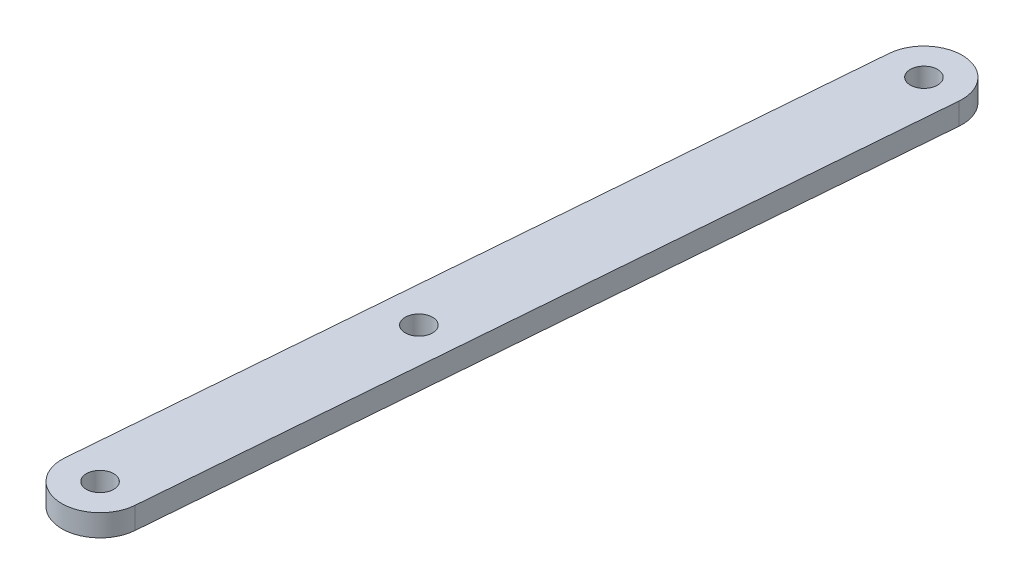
ISO-10303-21;
HEADER;
FILE_DESCRIPTION(('STEP AP214'),'2;1');
FILE_NAME('part.step','',(''),(''),'','','');
FILE_SCHEMA(('AUTOMOTIVE_DESIGN { 1 0 10303 214 1 1 1 1 }'));
ENDSEC;
DATA;
#1=APPLICATION_CONTEXT('core data for automotive mechanical design processes');
#2=APPLICATION_PROTOCOL_DEFINITION('international standard','automotive_design',2000,#1);
#3=PRODUCT_CONTEXT('',#1,'mechanical');
#4=PRODUCT('Part','Part','',(#3));
#5=PRODUCT_RELATED_PRODUCT_CATEGORY('part','',(#4));
#6=PRODUCT_DEFINITION_FORMATION('','',#4);
#7=PRODUCT_DEFINITION_CONTEXT('part definition',#1,'design');
#8=PRODUCT_DEFINITION('design','',#6,#7);
#9=PRODUCT_DEFINITION_SHAPE('','',#8);
#10=(LENGTH_UNIT() NAMED_UNIT(*) SI_UNIT(.MILLI.,.METRE.));
#11=(NAMED_UNIT(*) PLANE_ANGLE_UNIT() SI_UNIT($,.RADIAN.));
#12=(NAMED_UNIT(*) SI_UNIT($,.STERADIAN.) SOLID_ANGLE_UNIT());
#13=UNCERTAINTY_MEASURE_WITH_UNIT(LENGTH_MEASURE(1.E-05),#10,'distance_accuracy_value','');
#14=(GEOMETRIC_REPRESENTATION_CONTEXT(3) GLOBAL_UNCERTAINTY_ASSIGNED_CONTEXT((#13)) GLOBAL_UNIT_ASSIGNED_CONTEXT((#10,
#11,#12)) REPRESENTATION_CONTEXT('',''));
#15=CARTESIAN_POINT('',(0.,0.,0.));
#16=DIRECTION('',(0.,0.,1.));
#17=DIRECTION('',(1.,0.,0.));
#18=AXIS2_PLACEMENT_3D('',#15,#16,#17);
#19=CARTESIAN_POINT('',(71.0986960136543,10.1599999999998,-31.6603907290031));
#20=DIRECTION('',(0.,1.,0.));
#21=DIRECTION('',(0.,0.,1.));
#22=AXIS2_PLACEMENT_3D('',#19,#20,#21);
#23=PLANE('',#22);
#24=CARTESIAN_POINT('',(78.2916462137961,10.1599999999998,-120.268920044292));
#25=DIRECTION('',(0.,1.,0.));
#26=DIRECTION('',(0.,0.,1.));
#27=AXIS2_PLACEMENT_3D('',#24,#25,#26);
#28=CIRCLE('',#27,1.58749999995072);
#29=CARTESIAN_POINT('',(78.2916462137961,10.1599999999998,-118.681420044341));
#30=VERTEX_POINT('',#29);
#31=EDGE_CURVE('E124',#30,#30,#28,.T.);
#32=ORIENTED_EDGE('',*,*,#31,.F.);
#33=EDGE_LOOP('',(#32));
#34=FACE_BOUND('',#33,.T.);
#35=CARTESIAN_POINT('',(73.8822459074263,10.1599999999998,-65.9503907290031));
#36=DIRECTION('',(0.,1.,0.));
#37=DIRECTION('',(0.,0.,1.));
#38=AXIS2_PLACEMENT_3D('',#35,#36,#37);
#39=CIRCLE('',#38,1.58749999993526);
#40=CARTESIAN_POINT('',(73.8822459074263,10.1599999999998,-64.3628907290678));
#41=VERTEX_POINT('',#40);
#42=EDGE_CURVE('E100',#41,#41,#39,.T.);
#43=ORIENTED_EDGE('',*,*,#42,.F.);
#44=EDGE_LOOP('',(#43));
#45=FACE_BOUND('',#44,.T.);
#46=CARTESIAN_POINT('',(71.0986960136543,10.1599999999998,-31.6603907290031));
#47=DIRECTION('',(0.,1.,0.));
#48=DIRECTION('',(0.,0.,1.));
#49=AXIS2_PLACEMENT_3D('',#46,#47,#48);
#50=CIRCLE('',#49,4.44500000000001);
#51=CARTESIAN_POINT('',(66.6682695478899,10.1599999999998,-32.0200382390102));
#52=VERTEX_POINT('',#51);
#53=CARTESIAN_POINT('',(75.5291224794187,10.1599999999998,-31.300743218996));
#54=VERTEX_POINT('',#53);
#55=EDGE_CURVE('E85',#52,#54,#50,.T.);
#56=ORIENTED_EDGE('',*,*,#55,.T.);
#57=DIRECTION('',(0.0809105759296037,0.,-0.996721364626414));
#58=VECTOR('',#57,1.);
#59=CARTESIAN_POINT('',(75.5291224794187,10.1599999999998,-31.300743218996));
#60=LINE('',#59,#58);
#61=CARTESIAN_POINT('',(82.7220726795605,10.1599999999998,-119.909272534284));
#62=VERTEX_POINT('',#61);
#63=EDGE_CURVE('E80',#54,#62,#60,.T.);
#64=ORIENTED_EDGE('',*,*,#63,.T.);
#65=CARTESIAN_POINT('',(78.2916462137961,10.1599999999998,-120.268920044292));
#66=DIRECTION('',(0.,1.,0.));
#67=DIRECTION('',(0.,0.,1.));
#68=AXIS2_PLACEMENT_3D('',#65,#66,#67);
#69=CIRCLE('',#68,4.44500000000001);
#70=CARTESIAN_POINT('',(73.8612197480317,10.1599999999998,-120.628567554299));
#71=VERTEX_POINT('',#70);
#72=EDGE_CURVE('E83',#62,#71,#69,.T.);
#73=ORIENTED_EDGE('',*,*,#72,.T.);
#74=DIRECTION('',(-0.0809105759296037,0.,0.996721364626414));
#75=VECTOR('',#74,1.);
#76=CARTESIAN_POINT('',(66.6682695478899,10.1599999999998,-32.0200382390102));
#77=LINE('',#76,#75);
#78=EDGE_CURVE('E50',#71,#52,#77,.T.);
#79=ORIENTED_EDGE('',*,*,#78,.T.);
#80=EDGE_LOOP('',(#56,#64,#73,#79));
#81=FACE_BOUND('',#80,.T.);
#82=CARTESIAN_POINT('',(71.0986960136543,10.1599999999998,-31.6603907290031));
#83=DIRECTION('',(0.,1.,0.));
#84=DIRECTION('',(0.,0.,1.));
#85=AXIS2_PLACEMENT_3D('',#82,#83,#84);
#86=CIRCLE('',#85,1.58749999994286);
#87=CARTESIAN_POINT('',(71.0986960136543,10.1599999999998,-30.0728907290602));
#88=VERTEX_POINT('',#87);
#89=EDGE_CURVE('E115',#88,#88,#86,.T.);
#90=ORIENTED_EDGE('',*,*,#89,.F.);
#91=EDGE_LOOP('',(#90));
#92=FACE_BOUND('',#91,.T.);
#93=ADVANCED_FACE('F33',(#34,#45,#81,#92),#23,.T.);
#94=CARTESIAN_POINT('',(71.0986960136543,7.61999999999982,-31.6603907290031));
#95=DIRECTION('',(0.,1.,0.));
#96=DIRECTION('',(0.,0.,1.));
#97=AXIS2_PLACEMENT_3D('',#94,#95,#96);
#98=PLANE('',#97);
#99=CARTESIAN_POINT('',(78.2916462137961,7.61999999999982,-120.268920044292));
#100=DIRECTION('',(0.,1.,0.));
#101=DIRECTION('',(0.,0.,1.));
#102=AXIS2_PLACEMENT_3D('',#99,#100,#101);
#103=CIRCLE('',#102,1.58749999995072);
#104=CARTESIAN_POINT('',(78.2916462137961,7.61999999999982,-118.681420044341));
#105=VERTEX_POINT('',#104);
#106=EDGE_CURVE('E121',#105,#105,#103,.T.);
#107=ORIENTED_EDGE('',*,*,#106,.T.);
#108=EDGE_LOOP('',(#107));
#109=FACE_BOUND('',#108,.T.);
#110=CARTESIAN_POINT('',(73.8822459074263,7.61999999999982,-65.9503907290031));
#111=DIRECTION('',(0.,1.,0.));
#112=DIRECTION('',(0.,0.,1.));
#113=AXIS2_PLACEMENT_3D('',#110,#111,#112);
#114=CIRCLE('',#113,1.58749999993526);
#115=CARTESIAN_POINT('',(73.8822459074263,7.61999999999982,-64.3628907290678));
#116=VERTEX_POINT('',#115);
#117=EDGE_CURVE('E112',#116,#116,#114,.T.);
#118=ORIENTED_EDGE('',*,*,#117,.T.);
#119=EDGE_LOOP('',(#118));
#120=FACE_BOUND('',#119,.T.);
#121=CARTESIAN_POINT('',(71.0986960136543,7.61999999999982,-31.6603907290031));
#122=DIRECTION('',(0.,1.,0.));
#123=DIRECTION('',(0.,0.,1.));
#124=AXIS2_PLACEMENT_3D('',#121,#122,#123);
#125=CIRCLE('',#124,4.44500000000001);
#126=CARTESIAN_POINT('',(66.6682695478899,7.61999999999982,-32.0200382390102));
#127=VERTEX_POINT('',#126);
#128=CARTESIAN_POINT('',(75.5291224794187,7.61999999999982,-31.300743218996));
#129=VERTEX_POINT('',#128);
#130=EDGE_CURVE('E97',#127,#129,#125,.T.);
#131=ORIENTED_EDGE('',*,*,#130,.F.);
#132=DIRECTION('',(-0.0809105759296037,0.,0.996721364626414));
#133=VECTOR('',#132,1.);
#134=CARTESIAN_POINT('',(66.6682695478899,7.61999999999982,-32.0200382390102));
#135=LINE('',#134,#133);
#136=CARTESIAN_POINT('',(73.8612197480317,7.61999999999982,-120.628567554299));
#137=VERTEX_POINT('',#136);
#138=EDGE_CURVE('E73',#137,#127,#135,.T.);
#139=ORIENTED_EDGE('',*,*,#138,.F.);
#140=CARTESIAN_POINT('',(78.2916462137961,7.61999999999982,-120.268920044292));
#141=DIRECTION('',(0.,1.,0.));
#142=DIRECTION('',(0.,0.,1.));
#143=AXIS2_PLACEMENT_3D('',#140,#141,#142);
#144=CIRCLE('',#143,4.44500000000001);
#145=CARTESIAN_POINT('',(82.7220726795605,7.61999999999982,-119.909272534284));
#146=VERTEX_POINT('',#145);
#147=EDGE_CURVE('E67',#146,#137,#144,.T.);
#148=ORIENTED_EDGE('',*,*,#147,.F.);
#149=DIRECTION('',(0.0809105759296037,0.,-0.996721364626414));
#150=VECTOR('',#149,1.);
#151=CARTESIAN_POINT('',(75.5291224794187,7.61999999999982,-31.300743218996));
#152=LINE('',#151,#150);
#153=EDGE_CURVE('E89',#129,#146,#152,.T.);
#154=ORIENTED_EDGE('',*,*,#153,.F.);
#155=EDGE_LOOP('',(#131,#139,#148,#154));
#156=FACE_BOUND('',#155,.T.);
#157=CARTESIAN_POINT('',(71.0986960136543,7.61999999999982,-31.6603907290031));
#158=DIRECTION('',(0.,1.,0.));
#159=DIRECTION('',(0.,0.,1.));
#160=AXIS2_PLACEMENT_3D('',#157,#158,#159);
#161=CIRCLE('',#160,1.58749999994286);
#162=CARTESIAN_POINT('',(71.0986960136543,7.61999999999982,-30.0728907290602));
#163=VERTEX_POINT('',#162);
#164=EDGE_CURVE('E118',#163,#163,#161,.T.);
#165=ORIENTED_EDGE('',*,*,#164,.T.);
#166=EDGE_LOOP('',(#165));
#167=FACE_BOUND('',#166,.T.);
#168=ADVANCED_FACE('F108',(#109,#120,#156,#167),#98,.F.);
#169=CARTESIAN_POINT('',(71.0986960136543,10.1599999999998,-31.6603907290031));
#170=DIRECTION('',(0.,-1.,0.));
#171=DIRECTION('',(0.,0.,-1.));
#172=AXIS2_PLACEMENT_3D('',#169,#170,#171);
#173=CYLINDRICAL_SURFACE('',#172,4.44500000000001);
#174=ORIENTED_EDGE('',*,*,#130,.T.);
#175=DIRECTION('',(0.,-1.,0.));
#176=VECTOR('',#175,1.);
#177=CARTESIAN_POINT('',(75.5291224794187,10.1599999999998,-31.300743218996));
#178=LINE('',#177,#176);
#179=EDGE_CURVE('E11',#54,#129,#178,.T.);
#180=ORIENTED_EDGE('',*,*,#179,.F.);
#181=ORIENTED_EDGE('',*,*,#55,.F.);
#182=DIRECTION('',(0.,-1.,0.));
#183=VECTOR('',#182,1.);
#184=CARTESIAN_POINT('',(66.6682695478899,10.1599999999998,-32.0200382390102));
#185=LINE('',#184,#183);
#186=EDGE_CURVE('E93',#52,#127,#185,.T.);
#187=ORIENTED_EDGE('',*,*,#186,.T.);
#188=EDGE_LOOP('',(#174,#180,#181,#187));
#189=FACE_BOUND('',#188,.T.);
#190=ADVANCED_FACE('F35',(#189),#173,.T.);
#191=CARTESIAN_POINT('',(75.5291224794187,10.1599999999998,-31.300743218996));
#192=DIRECTION('',(-0.996721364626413,0.,-0.0809105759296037));
#193=DIRECTION('',(-0.0809105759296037,0.,0.996721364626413));
#194=AXIS2_PLACEMENT_3D('',#191,#192,#193);
#195=PLANE('',#194);
#196=ORIENTED_EDGE('',*,*,#153,.T.);
#197=DIRECTION('',(0.,-1.,0.));
#198=VECTOR('',#197,1.);
#199=CARTESIAN_POINT('',(82.7220726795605,10.1599999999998,-119.909272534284));
#200=LINE('',#199,#198);
#201=EDGE_CURVE('E42',#62,#146,#200,.T.);
#202=ORIENTED_EDGE('',*,*,#201,.F.);
#203=ORIENTED_EDGE('',*,*,#63,.F.);
#204=ORIENTED_EDGE('',*,*,#179,.T.);
#205=EDGE_LOOP('',(#196,#202,#203,#204));
#206=FACE_BOUND('',#205,.T.);
#207=ADVANCED_FACE('F88',(#206),#195,.F.);
#208=CARTESIAN_POINT('',(78.2916462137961,10.1599999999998,-120.268920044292));
#209=DIRECTION('',(0.,-1.,0.));
#210=DIRECTION('',(0.,0.,-1.));
#211=AXIS2_PLACEMENT_3D('',#208,#209,#210);
#212=CYLINDRICAL_SURFACE('',#211,4.44500000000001);
#213=ORIENTED_EDGE('',*,*,#147,.T.);
#214=DIRECTION('',(0.,-1.,0.));
#215=VECTOR('',#214,1.);
#216=CARTESIAN_POINT('',(73.8612197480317,10.1599999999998,-120.628567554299));
#217=LINE('',#216,#215);
#218=EDGE_CURVE('E90',#71,#137,#217,.T.);
#219=ORIENTED_EDGE('',*,*,#218,.F.);
#220=ORIENTED_EDGE('',*,*,#72,.F.);
#221=ORIENTED_EDGE('',*,*,#201,.T.);
#222=EDGE_LOOP('',(#213,#219,#220,#221));
#223=FACE_BOUND('',#222,.T.);
#224=ADVANCED_FACE('F91',(#223),#212,.T.);
#225=CARTESIAN_POINT('',(66.6682695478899,10.1599999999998,-32.0200382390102));
#226=DIRECTION('',(0.996721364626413,0.,0.0809105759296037));
#227=DIRECTION('',(0.0809105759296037,0.,-0.996721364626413));
#228=AXIS2_PLACEMENT_3D('',#225,#226,#227);
#229=PLANE('',#228);
#230=ORIENTED_EDGE('',*,*,#138,.T.);
#231=ORIENTED_EDGE('',*,*,#186,.F.);
#232=ORIENTED_EDGE('',*,*,#78,.F.);
#233=ORIENTED_EDGE('',*,*,#218,.T.);
#234=EDGE_LOOP('',(#230,#231,#232,#233));
#235=FACE_BOUND('',#234,.T.);
#236=ADVANCED_FACE('F105',(#235),#229,.F.);
#237=CARTESIAN_POINT('',(73.8822459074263,10.1599999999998,-65.9503907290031));
#238=DIRECTION('',(0.,-1.,0.));
#239=DIRECTION('',(0.,0.,-1.));
#240=AXIS2_PLACEMENT_3D('',#237,#238,#239);
#241=CYLINDRICAL_SURFACE('',#240,1.58749999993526);
#242=ORIENTED_EDGE('',*,*,#42,.T.);
#243=EDGE_LOOP('',(#242));
#244=FACE_BOUND('',#243,.T.);
#245=ORIENTED_EDGE('',*,*,#117,.F.);
#246=EDGE_LOOP('',(#245));
#247=FACE_BOUND('',#246,.T.);
#248=ADVANCED_FACE('F144',(#244,#247),#241,.F.);
#249=CARTESIAN_POINT('',(71.0986960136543,10.1599999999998,-31.6603907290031));
#250=DIRECTION('',(0.,-1.,0.));
#251=DIRECTION('',(0.,0.,-1.));
#252=AXIS2_PLACEMENT_3D('',#249,#250,#251);
#253=CYLINDRICAL_SURFACE('',#252,1.58749999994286);
#254=ORIENTED_EDGE('',*,*,#89,.T.);
#255=EDGE_LOOP('',(#254));
#256=FACE_BOUND('',#255,.T.);
#257=ORIENTED_EDGE('',*,*,#164,.F.);
#258=EDGE_LOOP('',(#257));
#259=FACE_BOUND('',#258,.T.);
#260=ADVANCED_FACE('F135',(#256,#259),#253,.F.);
#261=CARTESIAN_POINT('',(78.2916462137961,7.61999999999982,-120.268920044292));
#262=DIRECTION('',(0.,1.,0.));
#263=DIRECTION('',(0.,0.,1.));
#264=AXIS2_PLACEMENT_3D('',#261,#262,#263);
#265=CYLINDRICAL_SURFACE('',#264,1.58749999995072);
#266=ORIENTED_EDGE('',*,*,#106,.F.);
#267=EDGE_LOOP('',(#266));
#268=FACE_BOUND('',#267,.T.);
#269=ORIENTED_EDGE('',*,*,#31,.T.);
#270=EDGE_LOOP('',(#269));
#271=FACE_BOUND('',#270,.T.);
#272=ADVANCED_FACE('F132',(#268,#271),#265,.F.);
#273=CLOSED_SHELL('',(#93,#168,#190,#207,#224,#236,#248,#260,#272));
#274=MANIFOLD_SOLID_BREP('B2',#273);
#275=ADVANCED_BREP_SHAPE_REPRESENTATION('',(#18,#274),#14);
#276=SHAPE_DEFINITION_REPRESENTATION(#9,#275);
ENDSEC;
END-ISO-10303-21;
